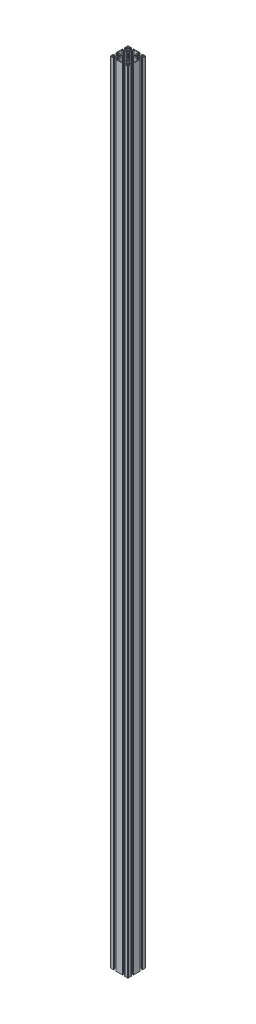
from build123d import *

# Parameters (mm, degrees)
EXTRUDE1_DEPTH = 4000


with BuildPart() as part:
    # Sketch1 → Extrude1 (new body)
    with BuildSketch(Plane(origin=(0, 0, 0), x_dir=(1, 0, 0), z_dir=(0, 1, 0))):
        with BuildLine():
            Line((583.705818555, 52.2039254), (583.705818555, 84.0339254))
            ThreePointArc((583.705818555, 84.0339254), (583.260620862, 85.108727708), (582.185818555, 85.5539254))
            Line((582.185818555, 85.5539254), (579.225818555, 85.5539254))
            ThreePointArc((579.225818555, 85.5539254), (578.151016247, 85.108727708), (577.705818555, 84.0339254))
            Line((577.705818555, 84.0339254), (577.705818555, 81.5689254))
            ThreePointArc((577.705818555, 81.5689254), (577.412925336, 80.861818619), (576.705818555, 80.5689254))
            Line((576.705818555, 80.5689254), (573.704245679, 80.5689254))
            ThreePointArc((573.704245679, 80.5689254), (573.558825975, 80.597851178), (573.435545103, 80.680224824))
            Line((573.435545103, 80.680224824), (570.817117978, 83.298651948))
            ThreePointArc((570.817117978, 83.298651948), (570.734744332, 83.421932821), (570.705818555, 83.567352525))
            Line((570.705818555, 83.567352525), (570.705818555, 89.718925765))
            Line((570.705818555, 89.718925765), (570.186205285, 90.6189254))
            Line((570.186205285, 90.6189254), (570.705818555, 91.518925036))
            Line((570.705818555, 91.518925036), (570.705818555, 97.670498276))
            ThreePointArc((570.705818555, 97.670498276), (570.734744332, 97.81591798), (570.817117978, 97.939198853))
            Line((570.817117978, 97.939198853), (573.435545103, 100.557625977))
            ThreePointArc((573.435545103, 100.557625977), (573.558825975, 100.639999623), (573.704245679, 100.6689254))
            Line((573.704245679, 100.6689254), (576.705818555, 100.6689254))
            ThreePointArc((576.705818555, 100.6689254), (577.412925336, 100.376032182), (577.705818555, 99.6689254))
            Line((577.705818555, 99.6689254), (577.705818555, 97.2039254))
            ThreePointArc((577.705818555, 97.2039254), (578.151016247, 96.129123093), (579.225818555, 95.6839254))
            Line((579.225818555, 95.6839254), (582.185818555, 95.6839254))
            ThreePointArc((582.185818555, 95.6839254), (583.260620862, 96.129123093), (583.705818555, 97.2039254))
            Line((583.705818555, 97.2039254), (583.705818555, 110.1189254))
            ThreePointArc((583.705818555, 110.1189254), (582.827138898, 112.240245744), (580.705818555, 113.1189254))
            Line((580.705818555, 113.1189254), (567.790818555, 113.1189254))
            ThreePointArc((567.790818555, 113.1189254), (566.716016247, 112.673727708), (566.270818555, 111.5989254))
            Line((566.270818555, 111.5989254), (566.270818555, 108.6389254))
            ThreePointArc((566.270818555, 108.6389254), (566.716016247, 107.564123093), (567.790818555, 107.1189254))
            Line((567.790818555, 107.1189254), (570.255818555, 107.1189254))
            ThreePointArc((570.255818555, 107.1189254), (570.962925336, 106.826032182), (571.255818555, 106.1189254))
            Line((571.255818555, 106.1189254), (571.255818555, 103.117352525))
            ThreePointArc((571.255818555, 103.117352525), (571.226892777, 102.971932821), (571.144519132, 102.848651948))
            Line((571.144519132, 102.848651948), (568.526092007, 100.230224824))
            ThreePointArc((568.526092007, 100.230224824), (568.402811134, 100.147851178), (568.25739143, 100.1189254))
            Line((568.25739143, 100.1189254), (562.105818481, 100.1189254))
            Line((562.105818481, 100.1189254), (561.205818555, 99.603777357))
            Line((561.205818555, 99.603777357), (560.305818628, 100.1189254))
            Line((560.305818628, 100.1189254), (554.154245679, 100.1189254))
            ThreePointArc((554.154245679, 100.1189254), (554.008825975, 100.147851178), (553.885545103, 100.230224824))
            Line((553.885545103, 100.230224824), (551.267117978, 102.848651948))
            ThreePointArc((551.267117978, 102.848651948), (551.184744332, 102.971932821), (551.155818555, 103.117352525))
            Line((551.155818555, 103.117352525), (551.155818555, 106.1189254))
            ThreePointArc((551.155818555, 106.1189254), (551.448711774, 106.826032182), (552.155818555, 107.1189254))
            Line((552.155818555, 107.1189254), (554.620818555, 107.1189254))
            ThreePointArc((554.620818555, 107.1189254), (555.695620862, 107.564123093), (556.140818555, 108.6389254))
            Line((556.140818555, 108.6389254), (556.140818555, 111.5989254))
            ThreePointArc((556.140818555, 111.5989254), (555.695620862, 112.673727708), (554.620818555, 113.1189254))
            Line((554.620818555, 113.1189254), (522.790818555, 113.1189254))
            ThreePointArc((522.790818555, 113.1189254), (521.716016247, 112.673727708), (521.270818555, 111.5989254))
            Line((521.270818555, 111.5989254), (521.270818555, 108.6389254))
            ThreePointArc((521.270818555, 108.6389254), (521.716016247, 107.564123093), (522.790818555, 107.1189254))
            Line((522.790818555, 107.1189254), (525.255818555, 107.1189254))
            ThreePointArc((525.255818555, 107.1189254), (525.962925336, 106.826032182), (526.255818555, 106.1189254))
            Line((526.255818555, 106.1189254), (526.255818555, 103.117352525))
            ThreePointArc((526.255818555, 103.117352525), (526.226892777, 102.971932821), (526.144519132, 102.848651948))
            Line((526.144519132, 102.848651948), (523.526092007, 100.230224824))
            ThreePointArc((523.526092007, 100.230224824), (523.402811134, 100.147851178), (523.25739143, 100.1189254))
            Line((523.25739143, 100.1189254), (517.105818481, 100.1189254))
            Line((517.105818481, 100.1189254), (516.205818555, 99.603777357))
            Line((516.205818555, 99.603777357), (515.305818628, 100.1189254))
            Line((515.305818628, 100.1189254), (509.154245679, 100.1189254))
            ThreePointArc((509.154245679, 100.1189254), (509.008825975, 100.147851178), (508.885545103, 100.230224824))
            Line((508.885545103, 100.230224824), (506.267117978, 102.848651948))
            ThreePointArc((506.267117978, 102.848651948), (506.184744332, 102.971932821), (506.155818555, 103.117352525))
            Line((506.155818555, 103.117352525), (506.155818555, 106.1189254))
            ThreePointArc((506.155818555, 106.1189254), (506.448711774, 106.826032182), (507.155818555, 107.1189254))
            Line((507.155818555, 107.1189254), (509.620818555, 107.1189254))
            ThreePointArc((509.620818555, 107.1189254), (510.695620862, 107.564123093), (511.140818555, 108.6389254))
            Line((511.140818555, 108.6389254), (511.140818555, 111.5989254))
            ThreePointArc((511.140818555, 111.5989254), (510.695620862, 112.673727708), (509.620818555, 113.1189254))
            Line((509.620818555, 113.1189254), (496.705818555, 113.1189254))
            ThreePointArc((496.705818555, 113.1189254), (494.584498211, 112.240245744), (493.705818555, 110.1189254))
            Line((493.705818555, 110.1189254), (493.705818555, 97.2039254))
            ThreePointArc((493.705818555, 97.2039254), (494.151016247, 96.129123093), (495.225818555, 95.6839254))
            Line((495.225818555, 95.6839254), (498.185818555, 95.6839254))
            ThreePointArc((498.185818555, 95.6839254), (499.260620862, 96.129123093), (499.705818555, 97.2039254))
            Line((499.705818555, 97.2039254), (499.705818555, 99.6689254))
            ThreePointArc((499.705818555, 99.6689254), (499.998711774, 100.376032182), (500.705818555, 100.6689254))
            Line((500.705818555, 100.6689254), (503.70739143, 100.6689254))
            ThreePointArc((503.70739143, 100.6689254), (503.852811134, 100.639999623), (503.976092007, 100.557625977))
            Line((503.976092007, 100.557625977), (506.594519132, 97.939198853))
            ThreePointArc((506.594519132, 97.939198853), (506.676892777, 97.81591798), (506.705818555, 97.670498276))
            Line((506.705818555, 97.670498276), (506.705818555, 91.518925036))
            Line((506.705818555, 91.518925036), (507.225431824, 90.6189254))
            Line((507.225431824, 90.6189254), (506.705818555, 89.718925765))
            Line((506.705818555, 89.718925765), (506.705818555, 83.567352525))
            ThreePointArc((506.705818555, 83.567352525), (506.676892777, 83.421932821), (506.594519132, 83.298651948))
            Line((506.594519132, 83.298651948), (503.976092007, 80.680224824))
            ThreePointArc((503.976092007, 80.680224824), (503.852811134, 80.597851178), (503.70739143, 80.5689254))
            Line((503.70739143, 80.5689254), (500.705818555, 80.5689254))
            ThreePointArc((500.705818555, 80.5689254), (499.998711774, 80.861818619), (499.705818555, 81.5689254))
            Line((499.705818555, 81.5689254), (499.705818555, 84.0339254))
            ThreePointArc((499.705818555, 84.0339254), (499.260620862, 85.108727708), (498.185818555, 85.5539254))
            Line((498.185818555, 85.5539254), (495.225818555, 85.5539254))
            ThreePointArc((495.225818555, 85.5539254), (494.151016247, 85.108727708), (493.705818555, 84.0339254))
            Line((493.705818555, 84.0339254), (493.705818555, 52.2039254))
            ThreePointArc((493.705818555, 52.2039254), (494.151016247, 51.129123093), (495.225818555, 50.6839254))
            Line((495.225818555, 50.6839254), (498.185818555, 50.6839254))
            ThreePointArc((498.185818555, 50.6839254), (499.260620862, 51.129123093), (499.705818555, 52.2039254))
            Line((499.705818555, 52.2039254), (499.705818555, 54.6689254))
            ThreePointArc((499.705818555, 54.6689254), (499.998711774, 55.376032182), (500.705818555, 55.6689254))
            Line((500.705818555, 55.6689254), (503.70739143, 55.6689254))
            ThreePointArc((503.70739143, 55.6689254), (503.852811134, 55.639999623), (503.976092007, 55.557625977))
            Line((503.976092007, 55.557625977), (506.594519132, 52.939198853))
            ThreePointArc((506.594519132, 52.939198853), (506.676892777, 52.81591798), (506.705818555, 52.670498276))
            Line((506.705818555, 52.670498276), (506.705818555, 46.518925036))
            Line((506.705818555, 46.518925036), (507.225431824, 45.6189254))
            Line((507.225431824, 45.6189254), (506.705818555, 44.718925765))
            Line((506.705818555, 44.718925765), (506.705818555, 38.567352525))
            ThreePointArc((506.705818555, 38.567352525), (506.676892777, 38.421932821), (506.594519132, 38.298651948))
            Line((506.594519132, 38.298651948), (503.976092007, 35.680224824))
            ThreePointArc((503.976092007, 35.680224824), (503.852811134, 35.597851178), (503.70739143, 35.5689254))
            Line((503.70739143, 35.5689254), (500.705818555, 35.5689254))
            ThreePointArc((500.705818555, 35.5689254), (499.998711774, 35.861818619), (499.705818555, 36.5689254))
            Line((499.705818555, 36.5689254), (499.705818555, 39.0339254))
            ThreePointArc((499.705818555, 39.0339254), (499.260620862, 40.108727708), (498.185818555, 40.5539254))
            Line((498.185818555, 40.5539254), (495.225818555, 40.5539254))
            ThreePointArc((495.225818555, 40.5539254), (494.151016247, 40.108727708), (493.705818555, 39.0339254))
            Line((493.705818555, 39.0339254), (493.705818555, 26.1189254))
            ThreePointArc((493.705818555, 26.1189254), (494.584498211, 23.997605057), (496.705818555, 23.1189254))
            Line((496.705818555, 23.1189254), (509.620818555, 23.1189254))
            ThreePointArc((509.620818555, 23.1189254), (510.695620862, 23.564123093), (511.140818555, 24.6389254))
            Line((511.140818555, 24.6389254), (511.140818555, 27.5989254))
            ThreePointArc((511.140818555, 27.5989254), (510.695620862, 28.673727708), (509.620818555, 29.1189254))
            Line((509.620818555, 29.1189254), (507.155818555, 29.1189254))
            ThreePointArc((507.155818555, 29.1189254), (506.448711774, 29.411818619), (506.155818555, 30.1189254))
            Line((506.155818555, 30.1189254), (506.155818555, 33.120498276))
            ThreePointArc((506.155818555, 33.120498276), (506.184744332, 33.26591798), (506.267117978, 33.389198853))
            Line((506.267117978, 33.389198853), (508.885545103, 36.007625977))
            ThreePointArc((508.885545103, 36.007625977), (509.008825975, 36.089999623), (509.154245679, 36.1189254))
            Line((509.154245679, 36.1189254), (515.305818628, 36.1189254))
            Line((515.305818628, 36.1189254), (516.205818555, 36.634073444))
            Line((516.205818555, 36.634073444), (517.105818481, 36.1189254))
            Line((517.105818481, 36.1189254), (523.25739143, 36.1189254))
            ThreePointArc((523.25739143, 36.1189254), (523.402811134, 36.089999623), (523.526092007, 36.007625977))
            Line((523.526092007, 36.007625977), (526.144519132, 33.389198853))
            ThreePointArc((526.144519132, 33.389198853), (526.226892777, 33.26591798), (526.255818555, 33.120498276))
            Line((526.255818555, 33.120498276), (526.255818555, 30.1189254))
            ThreePointArc((526.255818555, 30.1189254), (525.962925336, 29.411818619), (525.255818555, 29.1189254))
            Line((525.255818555, 29.1189254), (522.790818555, 29.1189254))
            ThreePointArc((522.790818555, 29.1189254), (521.716016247, 28.673727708), (521.270818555, 27.5989254))
            Line((521.270818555, 27.5989254), (521.270818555, 24.6389254))
            ThreePointArc((521.270818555, 24.6389254), (521.716016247, 23.564123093), (522.790818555, 23.1189254))
            Line((522.790818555, 23.1189254), (554.620818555, 23.1189254))
            ThreePointArc((554.620818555, 23.1189254), (555.695620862, 23.564123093), (556.140818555, 24.6389254))
            Line((556.140818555, 24.6389254), (556.140818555, 27.5989254))
            ThreePointArc((556.140818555, 27.5989254), (555.695620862, 28.673727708), (554.620818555, 29.1189254))
            Line((554.620818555, 29.1189254), (552.155818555, 29.1189254))
            ThreePointArc((552.155818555, 29.1189254), (551.448711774, 29.411818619), (551.155818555, 30.1189254))
            Line((551.155818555, 30.1189254), (551.155818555, 33.120498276))
            ThreePointArc((551.155818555, 33.120498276), (551.184744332, 33.26591798), (551.267117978, 33.389198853))
            Line((551.267117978, 33.389198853), (553.885545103, 36.007625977))
            ThreePointArc((553.885545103, 36.007625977), (554.008825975, 36.089999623), (554.154245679, 36.1189254))
            Line((554.154245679, 36.1189254), (560.305818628, 36.1189254))
            Line((560.305818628, 36.1189254), (561.205818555, 36.634073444))
            Line((561.205818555, 36.634073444), (562.105818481, 36.1189254))
            Line((562.105818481, 36.1189254), (568.25739143, 36.1189254))
            ThreePointArc((568.25739143, 36.1189254), (568.402811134, 36.089999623), (568.526092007, 36.007625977))
            Line((568.526092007, 36.007625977), (571.144519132, 33.389198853))
            ThreePointArc((571.144519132, 33.389198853), (571.226892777, 33.26591798), (571.255818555, 33.120498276))
            Line((571.255818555, 33.120498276), (571.255818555, 30.1189254))
            ThreePointArc((571.255818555, 30.1189254), (570.962925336, 29.411818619), (570.255818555, 29.1189254))
            Line((570.255818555, 29.1189254), (567.790818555, 29.1189254))
            ThreePointArc((567.790818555, 29.1189254), (566.716016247, 28.673727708), (566.270818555, 27.5989254))
            Line((566.270818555, 27.5989254), (566.270818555, 24.6389254))
            ThreePointArc((566.270818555, 24.6389254), (566.716016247, 23.564123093), (567.790818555, 23.1189254))
            Line((567.790818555, 23.1189254), (580.705818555, 23.1189254))
            ThreePointArc((580.705818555, 23.1189254), (582.827138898, 23.997605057), (583.705818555, 26.1189254))
            Line((583.705818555, 26.1189254), (583.705818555, 39.0339254))
            ThreePointArc((583.705818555, 39.0339254), (583.260620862, 40.108727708), (582.185818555, 40.5539254))
            Line((582.185818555, 40.5539254), (579.225818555, 40.5539254))
            ThreePointArc((579.225818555, 40.5539254), (578.151016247, 40.108727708), (577.705818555, 39.0339254))
            Line((577.705818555, 39.0339254), (577.705818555, 36.5689254))
            ThreePointArc((577.705818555, 36.5689254), (577.412925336, 35.861818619), (576.705818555, 35.5689254))
            Line((576.705818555, 35.5689254), (573.704245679, 35.5689254))
            ThreePointArc((573.704245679, 35.5689254), (573.558825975, 35.597851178), (573.435545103, 35.680224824))
            Line((573.435545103, 35.680224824), (570.817117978, 38.298651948))
            ThreePointArc((570.817117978, 38.298651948), (570.734744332, 38.421932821), (570.705818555, 38.567352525))
            Line((570.705818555, 38.567352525), (570.705818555, 44.718925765))
            Line((570.705818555, 44.718925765), (570.186205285, 45.6189254))
            Line((570.186205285, 45.6189254), (570.705818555, 46.518925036))
            Line((570.705818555, 46.518925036), (570.705818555, 52.670498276))
            ThreePointArc((570.705818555, 52.670498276), (570.734744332, 52.81591798), (570.817117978, 52.939198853))
            Line((570.817117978, 52.939198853), (573.435545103, 55.557625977))
            ThreePointArc((573.435545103, 55.557625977), (573.558825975, 55.639999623), (573.704245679, 55.6689254))
            Line((573.704245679, 55.6689254), (576.705818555, 55.6689254))
            ThreePointArc((576.705818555, 55.6689254), (577.412925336, 55.376032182), (577.705818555, 54.6689254))
            Line((577.705818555, 54.6689254), (577.705818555, 52.2039254))
            ThreePointArc((577.705818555, 52.2039254), (578.151016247, 51.129123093), (579.225818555, 50.6839254))
            Line((579.225818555, 50.6839254), (582.185818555, 50.6839254))
            ThreePointArc((582.185818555, 50.6839254), (583.260620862, 51.129123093), (583.705818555, 52.2039254))
        make_face()
        with BuildLine():
            Line((505.205818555, 27.1189254), (507.205818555, 27.1189254))
            ThreePointArc((507.205818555, 27.1189254), (508.205818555, 26.1189254), (507.205818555, 25.1189254))
            Line((507.205818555, 25.1189254), (496.705818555, 25.1189254))
            ThreePointArc((496.705818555, 25.1189254), (495.998711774, 25.411818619), (495.705818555, 26.1189254))
            Line((495.705818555, 26.1189254), (495.705818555, 36.6189254))
            ThreePointArc((495.705818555, 36.6189254), (496.705818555, 37.6189254), (497.705818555, 36.6189254))
            Line((497.705818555, 36.6189254), (497.705818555, 34.6189254))
            ThreePointArc((497.705818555, 34.6189254), (497.998711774, 33.911818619), (498.705818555, 33.6189254))
            Line((498.705818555, 33.6189254), (503.825818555, 33.6189254))
            ThreePointArc((503.825818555, 33.6189254), (504.094519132, 33.507625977), (504.205818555, 33.2389254))
            Line((504.205818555, 33.2389254), (504.205818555, 28.1189254))
            ThreePointArc((504.205818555, 28.1189254), (504.498711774, 27.411818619), (505.205818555, 27.1189254))
        make_face(mode=Mode.SUBTRACT)
        with BuildLine():
            Line((522.048789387, 41.895155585), (520.421815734, 42.930920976))
            ThreePointArc((520.421815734, 42.930920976), (519.741213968, 42.083253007), (518.893492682, 41.402717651))
            Line((518.893492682, 41.402717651), (519.929389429, 39.776006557))
            ThreePointArc((519.929389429, 39.776006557), (520.044180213, 38.95304823), (519.497336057, 38.327429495))
            ThreePointArc((519.497336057, 38.327429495), (519.2672114, 38.227858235), (519.034079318, 38.13554775))
            ThreePointArc((519.034079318, 38.13554775), (518.205090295, 38.191230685), (517.704319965, 38.854218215))
            Line((517.704319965, 38.854218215), (517.286272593, 40.737059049))
            ThreePointArc((517.286272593, 40.737059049), (516.2056227, 40.618925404), (515.124982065, 40.737143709))
            Line((515.124982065, 40.737143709), (514.707213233, 38.854395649))
            ThreePointArc((514.707213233, 38.854395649), (514.206463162, 38.191306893), (513.377406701, 38.135604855))
            ThreePointArc((513.377406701, 38.135604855), (513.144276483, 38.227920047), (512.914153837, 38.327495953))
            ThreePointArc((512.914153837, 38.327495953), (512.367343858, 38.953053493), (512.48204874, 39.775954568))
            Line((512.48204874, 39.775954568), (513.51781413, 41.402928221))
            ThreePointArc((513.51781413, 41.402928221), (512.670146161, 42.083529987), (511.989610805, 42.931251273))
            Line((511.989610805, 42.931251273), (510.362899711, 41.895354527))
            ThreePointArc((510.362899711, 41.895354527), (509.539941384, 41.780563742), (508.91432265, 42.327407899))
            ThreePointArc((508.91432265, 42.327407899), (508.814751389, 42.557532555), (508.722440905, 42.790664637))
            ThreePointArc((508.722440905, 42.790664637), (508.778123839, 43.61965366), (509.441111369, 44.12042399))
            Line((509.441111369, 44.12042399), (511.323952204, 44.538471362))
            ThreePointArc((511.323952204, 44.538471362), (511.205818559, 45.619121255), (511.324036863, 46.69976189))
            Line((511.324036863, 46.69976189), (509.441288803, 47.117530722))
            ThreePointArc((509.441288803, 47.117530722), (508.778200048, 47.618280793), (508.722498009, 48.447337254))
            ThreePointArc((508.722498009, 48.447337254), (508.814813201, 48.680467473), (508.914389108, 48.910590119))
            ThreePointArc((508.914389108, 48.910590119), (509.539946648, 49.457400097), (510.362847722, 49.342695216))
            Line((510.362847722, 49.342695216), (511.989821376, 48.306929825))
            ThreePointArc((511.989821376, 48.306929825), (512.670423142, 49.154597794), (513.518144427, 49.83513315))
            Line((513.518144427, 49.83513315), (512.482247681, 51.461844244))
            ThreePointArc((512.482247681, 51.461844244), (512.367456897, 52.284802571), (512.914301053, 52.910421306))
            ThreePointArc((512.914301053, 52.910421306), (513.144425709, 53.009992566), (513.377557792, 53.102303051))
            ThreePointArc((513.377557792, 53.102303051), (514.206546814, 53.046620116), (514.707317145, 52.383632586))
            Line((514.707317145, 52.383632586), (515.125364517, 50.500791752))
            ThreePointArc((515.125364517, 50.500791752), (516.206014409, 50.618925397), (517.286655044, 50.500707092))
            Line((517.286655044, 50.500707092), (517.704423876, 52.383455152))
            ThreePointArc((517.704423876, 52.383455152), (518.205173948, 53.046543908), (519.034230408, 53.102245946))
            ThreePointArc((519.034230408, 53.102245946), (519.267360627, 53.009930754), (519.497483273, 52.910354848))
            ThreePointArc((519.497483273, 52.910354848), (520.044293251, 52.284797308), (519.92958837, 51.461896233))
            Line((519.92958837, 51.461896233), (518.893822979, 49.834922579))
            ThreePointArc((518.893822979, 49.834922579), (519.741490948, 49.154320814), (520.422026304, 48.306599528))
            Line((520.422026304, 48.306599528), (522.048737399, 49.342496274))
            ThreePointArc((522.048737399, 49.342496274), (522.871695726, 49.457287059), (523.49731446, 48.910442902))
            ThreePointArc((523.49731446, 48.910442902), (523.59688572, 48.680318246), (523.689196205, 48.447186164))
            ThreePointArc((523.689196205, 48.447186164), (523.63351327, 47.618197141), (522.97052574, 47.11742681))
            Line((522.97052574, 47.11742681), (521.087684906, 46.699379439))
            ThreePointArc((521.087684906, 46.699379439), (521.205818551, 45.618729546), (521.087600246, 44.538088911))
            Line((521.087600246, 44.538088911), (522.970348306, 44.120320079))
            ThreePointArc((522.970348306, 44.120320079), (523.633437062, 43.619570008), (523.6891391, 42.790513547))
            ThreePointArc((523.6891391, 42.790513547), (523.596823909, 42.557383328), (523.497248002, 42.327260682))
            ThreePointArc((523.497248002, 42.327260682), (522.871690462, 41.780450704), (522.048789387, 41.895155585))
        make_face(mode=Mode.SUBTRACT)
        with BuildLine():
            Line((579.705818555, 34.6189254), (579.705818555, 36.6189254))
            ThreePointArc((579.705818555, 36.6189254), (580.705818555, 37.6189254), (581.705818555, 36.6189254))
            Line((581.705818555, 36.6189254), (581.705818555, 26.1189254))
            ThreePointArc((581.705818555, 26.1189254), (581.412925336, 25.411818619), (580.705818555, 25.1189254))
            Line((580.705818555, 25.1189254), (570.205818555, 25.1189254))
            ThreePointArc((570.205818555, 25.1189254), (569.205818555, 26.1189254), (570.205818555, 27.1189254))
            Line((570.205818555, 27.1189254), (572.205818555, 27.1189254))
            ThreePointArc((572.205818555, 27.1189254), (572.912925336, 27.411818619), (573.205818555, 28.1189254))
            Line((573.205818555, 28.1189254), (573.205818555, 33.2389254))
            ThreePointArc((573.205818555, 33.2389254), (573.317117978, 33.507625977), (573.585818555, 33.6189254))
            Line((573.585818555, 33.6189254), (578.705818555, 33.6189254))
            ThreePointArc((578.705818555, 33.6189254), (579.412925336, 33.911818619), (579.705818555, 34.6189254))
        make_face(mode=Mode.SUBTRACT)
        with BuildLine():
            Line((565.422026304, 48.306599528), (567.048737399, 49.342496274))
            ThreePointArc((567.048737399, 49.342496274), (567.871695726, 49.457287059), (568.49731446, 48.910442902))
            ThreePointArc((568.49731446, 48.910442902), (568.59688572, 48.680318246), (568.689196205, 48.447186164))
            ThreePointArc((568.689196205, 48.447186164), (568.63351327, 47.618197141), (567.970525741, 47.11742681))
            Line((567.970525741, 47.11742681), (566.087684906, 46.699379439))
            ThreePointArc((566.087684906, 46.699379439), (566.205818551, 45.618729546), (566.087600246, 44.538088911))
            Line((566.087600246, 44.538088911), (567.970348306, 44.120320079))
            ThreePointArc((567.970348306, 44.120320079), (568.633437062, 43.619570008), (568.6891391, 42.790513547))
            ThreePointArc((568.6891391, 42.790513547), (568.596823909, 42.557383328), (568.497248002, 42.327260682))
            ThreePointArc((568.497248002, 42.327260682), (567.871690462, 41.780450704), (567.048789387, 41.895155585))
            Line((567.048789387, 41.895155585), (565.421815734, 42.930920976))
            ThreePointArc((565.421815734, 42.930920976), (564.741213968, 42.083253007), (563.893492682, 41.402717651))
            Line((563.893492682, 41.402717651), (564.929389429, 39.776006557))
            ThreePointArc((564.929389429, 39.776006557), (565.044180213, 38.95304823), (564.497336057, 38.327429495))
            ThreePointArc((564.497336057, 38.327429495), (564.2672114, 38.227858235), (564.034079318, 38.13554775))
            ThreePointArc((564.034079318, 38.13554775), (563.205090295, 38.191230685), (562.704319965, 38.854218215))
            Line((562.704319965, 38.854218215), (562.286272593, 40.737059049))
            ThreePointArc((562.286272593, 40.737059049), (561.2056227, 40.618925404), (560.124982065, 40.737143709))
            Line((560.124982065, 40.737143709), (559.707213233, 38.854395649))
            ThreePointArc((559.707213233, 38.854395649), (559.206463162, 38.191306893), (558.377406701, 38.135604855))
            ThreePointArc((558.377406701, 38.135604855), (558.144276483, 38.227920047), (557.914153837, 38.327495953))
            ThreePointArc((557.914153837, 38.327495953), (557.367343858, 38.953053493), (557.48204874, 39.775954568))
            Line((557.48204874, 39.775954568), (558.51781413, 41.402928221))
            ThreePointArc((558.51781413, 41.402928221), (557.670146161, 42.083529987), (556.989610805, 42.931251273))
            Line((556.989610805, 42.931251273), (555.362899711, 41.895354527))
            ThreePointArc((555.362899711, 41.895354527), (554.539941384, 41.780563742), (553.91432265, 42.327407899))
            ThreePointArc((553.91432265, 42.327407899), (553.814751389, 42.557532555), (553.722440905, 42.790664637))
            ThreePointArc((553.722440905, 42.790664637), (553.778123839, 43.61965366), (554.441111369, 44.12042399))
            Line((554.441111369, 44.12042399), (556.323952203, 44.538471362))
            ThreePointArc((556.323952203, 44.538471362), (556.205818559, 45.619121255), (556.324036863, 46.69976189))
            Line((556.324036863, 46.69976189), (554.441288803, 47.117530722))
            ThreePointArc((554.441288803, 47.117530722), (553.778200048, 47.618280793), (553.722498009, 48.447337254))
            ThreePointArc((553.722498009, 48.447337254), (553.814813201, 48.680467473), (553.914389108, 48.910590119))
            ThreePointArc((553.914389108, 48.910590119), (554.539946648, 49.457400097), (555.362847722, 49.342695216))
            Line((555.362847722, 49.342695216), (556.989821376, 48.306929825))
            ThreePointArc((556.989821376, 48.306929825), (557.670423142, 49.154597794), (558.518144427, 49.83513315))
            Line((558.518144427, 49.83513315), (557.482247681, 51.461844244))
            ThreePointArc((557.482247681, 51.461844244), (557.367456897, 52.284802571), (557.914301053, 52.910421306))
            ThreePointArc((557.914301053, 52.910421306), (558.144425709, 53.009992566), (558.377557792, 53.102303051))
            ThreePointArc((558.377557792, 53.102303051), (559.206546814, 53.046620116), (559.707317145, 52.383632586))
            Line((559.707317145, 52.383632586), (560.125364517, 50.500791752))
            ThreePointArc((560.125364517, 50.500791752), (561.206014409, 50.618925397), (562.286655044, 50.500707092))
            Line((562.286655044, 50.500707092), (562.704423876, 52.383455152))
            ThreePointArc((562.704423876, 52.383455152), (563.205173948, 53.046543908), (564.034230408, 53.102245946))
            ThreePointArc((564.034230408, 53.102245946), (564.267360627, 53.009930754), (564.497483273, 52.910354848))
            ThreePointArc((564.497483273, 52.910354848), (565.044293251, 52.284797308), (564.92958837, 51.461896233))
            Line((564.92958837, 51.461896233), (563.893822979, 49.834922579))
            ThreePointArc((563.893822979, 49.834922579), (564.741490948, 49.154320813), (565.422026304, 48.306599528))
        make_face(mode=Mode.SUBTRACT)
        with BuildLine():
            Line((573.205818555, 102.9989254), (573.205818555, 108.1189254))
            ThreePointArc((573.205818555, 108.1189254), (572.912925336, 108.826032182), (572.205818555, 109.1189254))
            Line((572.205818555, 109.1189254), (570.205818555, 109.1189254))
            ThreePointArc((570.205818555, 109.1189254), (569.205818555, 110.1189254), (570.205818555, 111.1189254))
            Line((570.205818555, 111.1189254), (580.705818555, 111.1189254))
            ThreePointArc((580.705818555, 111.1189254), (581.412925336, 110.826032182), (581.705818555, 110.1189254))
            Line((581.705818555, 110.1189254), (581.705818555, 99.6189254))
            ThreePointArc((581.705818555, 99.6189254), (580.705818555, 98.6189254), (579.705818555, 99.6189254))
            Line((579.705818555, 99.6189254), (579.705818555, 101.6189254))
            ThreePointArc((579.705818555, 101.6189254), (579.412925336, 102.326032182), (578.705818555, 102.6189254))
            Line((578.705818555, 102.6189254), (573.585818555, 102.6189254))
            ThreePointArc((573.585818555, 102.6189254), (573.317117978, 102.730224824), (573.205818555, 102.9989254))
        make_face(mode=Mode.SUBTRACT)
        with BuildLine():
            Line((565.422026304, 93.306599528), (567.048737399, 94.342496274))
            ThreePointArc((567.048737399, 94.342496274), (567.871695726, 94.457287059), (568.49731446, 93.910442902))
            ThreePointArc((568.49731446, 93.910442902), (568.59688572, 93.680318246), (568.689196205, 93.447186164))
            ThreePointArc((568.689196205, 93.447186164), (568.63351327, 92.618197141), (567.970525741, 92.11742681))
            Line((567.970525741, 92.11742681), (566.087684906, 91.699379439))
            ThreePointArc((566.087684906, 91.699379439), (566.205818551, 90.618729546), (566.087600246, 89.538088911))
            Line((566.087600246, 89.538088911), (567.970348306, 89.120320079))
            ThreePointArc((567.970348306, 89.120320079), (568.633437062, 88.619570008), (568.6891391, 87.790513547))
            ThreePointArc((568.6891391, 87.790513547), (568.596823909, 87.557383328), (568.497248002, 87.327260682))
            ThreePointArc((568.497248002, 87.327260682), (567.871690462, 86.780450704), (567.048789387, 86.895155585))
            Line((567.048789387, 86.895155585), (565.421815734, 87.930920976))
            ThreePointArc((565.421815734, 87.930920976), (564.741213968, 87.083253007), (563.893492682, 86.402717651))
            Line((563.893492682, 86.402717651), (564.929389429, 84.776006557))
            ThreePointArc((564.929389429, 84.776006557), (565.044180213, 83.95304823), (564.497336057, 83.327429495))
            ThreePointArc((564.497336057, 83.327429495), (564.2672114, 83.227858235), (564.034079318, 83.13554775))
            ThreePointArc((564.034079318, 83.13554775), (563.205090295, 83.191230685), (562.704319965, 83.854218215))
            Line((562.704319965, 83.854218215), (562.286272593, 85.737059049))
            ThreePointArc((562.286272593, 85.737059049), (561.2056227, 85.618925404), (560.124982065, 85.737143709))
            Line((560.124982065, 85.737143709), (559.707213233, 83.854395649))
            ThreePointArc((559.707213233, 83.854395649), (559.206463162, 83.191306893), (558.377406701, 83.135604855))
            ThreePointArc((558.377406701, 83.135604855), (558.144276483, 83.227920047), (557.914153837, 83.327495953))
            ThreePointArc((557.914153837, 83.327495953), (557.367343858, 83.953053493), (557.48204874, 84.775954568))
            Line((557.48204874, 84.775954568), (558.51781413, 86.402928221))
            ThreePointArc((558.51781413, 86.402928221), (557.670146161, 87.083529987), (556.989610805, 87.931251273))
            Line((556.989610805, 87.931251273), (555.362899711, 86.895354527))
            ThreePointArc((555.362899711, 86.895354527), (554.539941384, 86.780563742), (553.91432265, 87.327407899))
            ThreePointArc((553.91432265, 87.327407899), (553.814751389, 87.557532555), (553.722440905, 87.790664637))
            ThreePointArc((553.722440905, 87.790664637), (553.778123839, 88.61965366), (554.441111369, 89.12042399))
            Line((554.441111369, 89.12042399), (556.323952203, 89.538471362))
            ThreePointArc((556.323952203, 89.538471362), (556.205818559, 90.619121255), (556.324036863, 91.69976189))
            Line((556.324036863, 91.69976189), (554.441288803, 92.117530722))
            ThreePointArc((554.441288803, 92.117530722), (553.778200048, 92.618280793), (553.722498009, 93.447337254))
            ThreePointArc((553.722498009, 93.447337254), (553.814813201, 93.680467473), (553.914389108, 93.910590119))
            ThreePointArc((553.914389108, 93.910590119), (554.539946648, 94.457400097), (555.362847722, 94.342695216))
            Line((555.362847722, 94.342695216), (556.989821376, 93.306929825))
            ThreePointArc((556.989821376, 93.306929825), (557.670423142, 94.154597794), (558.518144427, 94.83513315))
            Line((558.518144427, 94.83513315), (557.482247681, 96.461844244))
            ThreePointArc((557.482247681, 96.461844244), (557.367456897, 97.284802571), (557.914301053, 97.910421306))
            ThreePointArc((557.914301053, 97.910421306), (558.144425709, 98.009992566), (558.377557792, 98.102303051))
            ThreePointArc((558.377557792, 98.102303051), (559.206546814, 98.046620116), (559.707317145, 97.383632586))
            Line((559.707317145, 97.383632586), (560.125364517, 95.500791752))
            ThreePointArc((560.125364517, 95.500791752), (561.206014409, 95.618925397), (562.286655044, 95.500707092))
            Line((562.286655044, 95.500707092), (562.704423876, 97.383455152))
            ThreePointArc((562.704423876, 97.383455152), (563.205173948, 98.046543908), (564.034230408, 98.102245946))
            ThreePointArc((564.034230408, 98.102245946), (564.267360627, 98.009930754), (564.497483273, 97.910354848))
            ThreePointArc((564.497483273, 97.910354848), (565.044293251, 97.284797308), (564.92958837, 96.461896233))
            Line((564.92958837, 96.461896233), (563.893822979, 94.834922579))
            ThreePointArc((563.893822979, 94.834922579), (564.741490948, 94.154320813), (565.422026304, 93.306599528))
        make_face(mode=Mode.SUBTRACT)
        with BuildLine():
            Line((497.705818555, 101.6189254), (497.705818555, 99.6189254))
            ThreePointArc((497.705818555, 99.6189254), (496.705818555, 98.6189254), (495.705818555, 99.6189254))
            Line((495.705818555, 99.6189254), (495.705818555, 110.1189254))
            ThreePointArc((495.705818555, 110.1189254), (495.998711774, 110.826032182), (496.705818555, 111.1189254))
            Line((496.705818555, 111.1189254), (507.205818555, 111.1189254))
            ThreePointArc((507.205818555, 111.1189254), (508.205818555, 110.1189254), (507.205818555, 109.1189254))
            Line((507.205818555, 109.1189254), (505.205818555, 109.1189254))
            ThreePointArc((505.205818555, 109.1189254), (504.498711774, 108.826032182), (504.205818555, 108.1189254))
            Line((504.205818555, 108.1189254), (504.205818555, 102.9989254))
            ThreePointArc((504.205818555, 102.9989254), (504.094519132, 102.730224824), (503.825818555, 102.6189254))
            Line((503.825818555, 102.6189254), (498.705818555, 102.6189254))
            ThreePointArc((498.705818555, 102.6189254), (497.998711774, 102.326032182), (497.705818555, 101.6189254))
        make_face(mode=Mode.SUBTRACT)
        with BuildLine():
            Line((522.048789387, 86.895155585), (520.421815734, 87.930920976))
            ThreePointArc((520.421815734, 87.930920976), (519.741213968, 87.083253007), (518.893492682, 86.402717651))
            Line((518.893492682, 86.402717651), (519.929389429, 84.776006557))
            ThreePointArc((519.929389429, 84.776006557), (520.044180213, 83.95304823), (519.497336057, 83.327429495))
            ThreePointArc((519.497336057, 83.327429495), (519.2672114, 83.227858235), (519.034079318, 83.13554775))
            ThreePointArc((519.034079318, 83.13554775), (518.205090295, 83.191230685), (517.704319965, 83.854218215))
            Line((517.704319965, 83.854218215), (517.286272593, 85.737059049))
            ThreePointArc((517.286272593, 85.737059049), (516.2056227, 85.618925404), (515.124982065, 85.737143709))
            Line((515.124982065, 85.737143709), (514.707213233, 83.854395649))
            ThreePointArc((514.707213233, 83.854395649), (514.206463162, 83.191306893), (513.377406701, 83.135604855))
            ThreePointArc((513.377406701, 83.135604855), (513.144276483, 83.227920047), (512.914153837, 83.327495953))
            ThreePointArc((512.914153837, 83.327495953), (512.367343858, 83.953053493), (512.48204874, 84.775954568))
            Line((512.48204874, 84.775954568), (513.51781413, 86.402928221))
            ThreePointArc((513.51781413, 86.402928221), (512.670146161, 87.083529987), (511.989610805, 87.931251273))
            Line((511.989610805, 87.931251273), (510.362899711, 86.895354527))
            ThreePointArc((510.362899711, 86.895354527), (509.539941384, 86.780563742), (508.91432265, 87.327407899))
            ThreePointArc((508.91432265, 87.327407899), (508.814751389, 87.557532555), (508.722440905, 87.790664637))
            ThreePointArc((508.722440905, 87.790664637), (508.778123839, 88.61965366), (509.441111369, 89.12042399))
            Line((509.441111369, 89.12042399), (511.323952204, 89.538471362))
            ThreePointArc((511.323952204, 89.538471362), (511.205818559, 90.619121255), (511.324036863, 91.69976189))
            Line((511.324036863, 91.69976189), (509.441288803, 92.117530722))
            ThreePointArc((509.441288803, 92.117530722), (508.778200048, 92.618280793), (508.722498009, 93.447337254))
            ThreePointArc((508.722498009, 93.447337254), (508.814813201, 93.680467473), (508.914389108, 93.910590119))
            ThreePointArc((508.914389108, 93.910590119), (509.539946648, 94.457400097), (510.362847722, 94.342695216))
            Line((510.362847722, 94.342695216), (511.989821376, 93.306929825))
            ThreePointArc((511.989821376, 93.306929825), (512.670423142, 94.154597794), (513.518144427, 94.83513315))
            Line((513.518144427, 94.83513315), (512.482247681, 96.461844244))
            ThreePointArc((512.482247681, 96.461844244), (512.367456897, 97.284802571), (512.914301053, 97.910421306))
            ThreePointArc((512.914301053, 97.910421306), (513.144425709, 98.009992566), (513.377557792, 98.102303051))
            ThreePointArc((513.377557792, 98.102303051), (514.206546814, 98.046620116), (514.707317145, 97.383632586))
            Line((514.707317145, 97.383632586), (515.125364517, 95.500791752))
            ThreePointArc((515.125364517, 95.500791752), (516.206014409, 95.618925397), (517.286655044, 95.500707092))
            Line((517.286655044, 95.500707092), (517.704423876, 97.383455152))
            ThreePointArc((517.704423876, 97.383455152), (518.205173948, 98.046543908), (519.034230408, 98.102245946))
            ThreePointArc((519.034230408, 98.102245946), (519.267360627, 98.009930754), (519.497483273, 97.910354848))
            ThreePointArc((519.497483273, 97.910354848), (520.044293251, 97.284797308), (519.92958837, 96.461896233))
            Line((519.92958837, 96.461896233), (518.893822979, 94.834922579))
            ThreePointArc((518.893822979, 94.834922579), (519.741490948, 94.154320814), (520.422026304, 93.306599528))
            Line((520.422026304, 93.306599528), (522.048737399, 94.342496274))
            ThreePointArc((522.048737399, 94.342496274), (522.871695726, 94.457287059), (523.49731446, 93.910442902))
            ThreePointArc((523.49731446, 93.910442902), (523.59688572, 93.680318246), (523.689196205, 93.447186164))
            ThreePointArc((523.689196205, 93.447186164), (523.63351327, 92.618197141), (522.97052574, 92.11742681))
            Line((522.97052574, 92.11742681), (521.087684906, 91.699379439))
            ThreePointArc((521.087684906, 91.699379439), (521.205818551, 90.618729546), (521.087600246, 89.538088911))
            Line((521.087600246, 89.538088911), (522.970348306, 89.120320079))
            ThreePointArc((522.970348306, 89.120320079), (523.633437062, 88.619570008), (523.6891391, 87.790513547))
            ThreePointArc((523.6891391, 87.790513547), (523.596823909, 87.557383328), (523.497248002, 87.327260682))
            ThreePointArc((523.497248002, 87.327260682), (522.871690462, 86.780450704), (522.048789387, 86.895155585))
        make_face(mode=Mode.SUBTRACT)
        with BuildLine():
            Line((577.705818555, 57.9589254), (572.083219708, 57.9589254))
            ThreePointArc((572.083219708, 57.9589254), (571.317852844, 57.806684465), (570.669006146, 57.373138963))
            Line((570.669006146, 57.373138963), (568.526092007, 55.230224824))
            ThreePointArc((568.526092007, 55.230224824), (568.402811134, 55.147851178), (568.25739143, 55.1189254))
            Line((568.25739143, 55.1189254), (562.105818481, 55.1189254))
            Line((562.105818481, 55.1189254), (561.205818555, 54.603777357))
            Line((561.205818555, 54.603777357), (560.305818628, 55.1189254))
            Line((560.305818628, 55.1189254), (553.705818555, 55.1189254))
            ThreePointArc((553.705818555, 55.1189254), (552.291604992, 54.533138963), (551.705818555, 53.1189254))
            Line((551.705818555, 53.1189254), (551.705818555, 46.518925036))
            Line((551.705818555, 46.518925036), (552.225431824, 45.6189254))
            Line((552.225431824, 45.6189254), (551.705818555, 44.718925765))
            Line((551.705818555, 44.718925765), (551.705818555, 38.567352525))
            ThreePointArc((551.705818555, 38.567352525), (551.676892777, 38.421932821), (551.594519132, 38.298651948))
            Line((551.594519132, 38.298651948), (550.084498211, 36.788631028))
            ThreePointArc((550.084498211, 36.788631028), (549.434179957, 35.815360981), (549.205818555, 34.667310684))
            Line((549.205818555, 34.667310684), (549.205818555, 28.1189254))
            ThreePointArc((549.205818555, 28.1189254), (549.498711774, 27.411818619), (550.205818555, 27.1189254))
            Line((550.205818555, 27.1189254), (552.205818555, 27.1189254))
            ThreePointArc((552.205818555, 27.1189254), (553.205818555, 26.1189254), (552.205818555, 25.1189254))
            Line((552.205818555, 25.1189254), (525.205818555, 25.1189254))
            ThreePointArc((525.205818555, 25.1189254), (524.205818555, 26.1189254), (525.205818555, 27.1189254))
            Line((525.205818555, 27.1189254), (527.205818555, 27.1189254))
            ThreePointArc((527.205818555, 27.1189254), (527.912925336, 27.411818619), (528.205818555, 28.1189254))
            Line((528.205818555, 28.1189254), (528.205818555, 34.667310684))
            ThreePointArc((528.205818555, 34.667310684), (527.977457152, 35.815360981), (527.327138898, 36.788631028))
            Line((527.327138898, 36.788631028), (525.817117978, 38.298651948))
            ThreePointArc((525.817117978, 38.298651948), (525.734744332, 38.421932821), (525.705818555, 38.567352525))
            Line((525.705818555, 38.567352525), (525.705818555, 44.718925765))
            Line((525.705818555, 44.718925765), (525.186205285, 45.6189254))
            Line((525.186205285, 45.6189254), (525.705818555, 46.518925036))
            Line((525.705818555, 46.518925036), (525.705818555, 53.1189254))
            ThreePointArc((525.705818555, 53.1189254), (525.120032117, 54.533138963), (523.705818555, 55.1189254))
            Line((523.705818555, 55.1189254), (517.105818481, 55.1189254))
            Line((517.105818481, 55.1189254), (516.205818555, 54.603777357))
            Line((516.205818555, 54.603777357), (515.305818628, 55.1189254))
            Line((515.305818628, 55.1189254), (509.154245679, 55.1189254))
            ThreePointArc((509.154245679, 55.1189254), (509.008825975, 55.147851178), (508.885545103, 55.230224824))
            Line((508.885545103, 55.230224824), (506.742630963, 57.373138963))
            ThreePointArc((506.742630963, 57.373138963), (506.093784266, 57.806684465), (505.328417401, 57.9589254))
            Line((505.328417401, 57.9589254), (499.705818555, 57.9589254))
            ThreePointArc((499.705818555, 57.9589254), (498.291604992, 57.373138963), (497.705818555, 55.9589254))
            Line((497.705818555, 55.9589254), (497.705818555, 54.6189254))
            ThreePointArc((497.705818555, 54.6189254), (496.705818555, 53.6189254), (495.705818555, 54.6189254))
            Line((495.705818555, 54.6189254), (495.705818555, 81.6189254))
            ThreePointArc((495.705818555, 81.6189254), (496.705818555, 82.6189254), (497.705818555, 81.6189254))
            Line((497.705818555, 81.6189254), (497.705818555, 80.2789254))
            ThreePointArc((497.705818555, 80.2789254), (498.291604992, 78.864711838), (499.705818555, 78.2789254))
            Line((499.705818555, 78.2789254), (505.328417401, 78.2789254))
            ThreePointArc((505.328417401, 78.2789254), (506.093784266, 78.431166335), (506.742630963, 78.864711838))
            Line((506.742630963, 78.864711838), (508.885545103, 81.007625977))
            ThreePointArc((508.885545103, 81.007625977), (509.008825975, 81.089999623), (509.154245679, 81.1189254))
            Line((509.154245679, 81.1189254), (515.305818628, 81.1189254))
            Line((515.305818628, 81.1189254), (516.205818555, 81.634073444))
            Line((516.205818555, 81.634073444), (517.105818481, 81.1189254))
            Line((517.105818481, 81.1189254), (523.705818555, 81.1189254))
            ThreePointArc((523.705818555, 81.1189254), (525.120032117, 81.704711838), (525.705818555, 83.1189254))
            Line((525.705818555, 83.1189254), (525.705818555, 89.718925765))
            Line((525.705818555, 89.718925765), (525.186205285, 90.6189254))
            Line((525.186205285, 90.6189254), (525.705818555, 91.518925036))
            Line((525.705818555, 91.518925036), (525.705818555, 97.670498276))
            ThreePointArc((525.705818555, 97.670498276), (525.734744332, 97.81591798), (525.817117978, 97.939198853))
            Line((525.817117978, 97.939198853), (527.327138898, 99.449219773))
            ThreePointArc((527.327138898, 99.449219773), (527.977457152, 100.422489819), (528.205818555, 101.570540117))
            Line((528.205818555, 101.570540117), (528.205818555, 108.1189254))
            ThreePointArc((528.205818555, 108.1189254), (527.912925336, 108.826032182), (527.205818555, 109.1189254))
            Line((527.205818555, 109.1189254), (525.205818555, 109.1189254))
            ThreePointArc((525.205818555, 109.1189254), (524.205818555, 110.1189254), (525.205818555, 111.1189254))
            Line((525.205818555, 111.1189254), (552.205818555, 111.1189254))
            ThreePointArc((552.205818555, 111.1189254), (553.205818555, 110.1189254), (552.205818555, 109.1189254))
            Line((552.205818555, 109.1189254), (550.205818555, 109.1189254))
            ThreePointArc((550.205818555, 109.1189254), (549.498711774, 108.826032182), (549.205818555, 108.1189254))
            Line((549.205818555, 108.1189254), (549.205818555, 101.570540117))
            ThreePointArc((549.205818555, 101.570540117), (549.434179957, 100.422489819), (550.084498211, 99.449219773))
            Line((550.084498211, 99.449219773), (551.594519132, 97.939198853))
            ThreePointArc((551.594519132, 97.939198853), (551.676892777, 97.81591798), (551.705818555, 97.670498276))
            Line((551.705818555, 97.670498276), (551.705818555, 91.518925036))
            Line((551.705818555, 91.518925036), (552.225431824, 90.6189254))
            Line((552.225431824, 90.6189254), (551.705818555, 89.718925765))
            Line((551.705818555, 89.718925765), (551.705818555, 83.1189254))
            ThreePointArc((551.705818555, 83.1189254), (552.291604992, 81.704711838), (553.705818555, 81.1189254))
            Line((553.705818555, 81.1189254), (560.305818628, 81.1189254))
            Line((560.305818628, 81.1189254), (561.205818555, 81.634073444))
            Line((561.205818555, 81.634073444), (562.105818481, 81.1189254))
            Line((562.105818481, 81.1189254), (568.25739143, 81.1189254))
            ThreePointArc((568.25739143, 81.1189254), (568.402811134, 81.089999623), (568.526092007, 81.007625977))
            Line((568.526092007, 81.007625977), (570.66392396, 78.869794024))
            ThreePointArc((570.66392396, 78.869794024), (571.312770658, 78.436248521), (572.078137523, 78.284007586))
            Line((572.078137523, 78.284007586), (577.705818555, 78.284007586))
            ThreePointArc((577.705818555, 78.284007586), (579.120032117, 78.869794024), (579.705818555, 80.284007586))
            Line((579.705818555, 80.284007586), (579.705818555, 81.6189254))
            ThreePointArc((579.705818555, 81.6189254), (580.705818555, 82.6189254), (581.705818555, 81.6189254))
            Line((581.705818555, 81.6189254), (581.705818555, 54.6189254))
            ThreePointArc((581.705818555, 54.6189254), (580.705818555, 53.6189254), (579.705818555, 54.6189254))
            Line((579.705818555, 54.6189254), (579.705818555, 55.9589254))
            ThreePointArc((579.705818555, 55.9589254), (579.120032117, 57.373138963), (577.705818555, 57.9589254))
        make_face(mode=Mode.SUBTRACT)
    extrude(amount=EXTRUDE1_DEPTH)


solid = part.part
